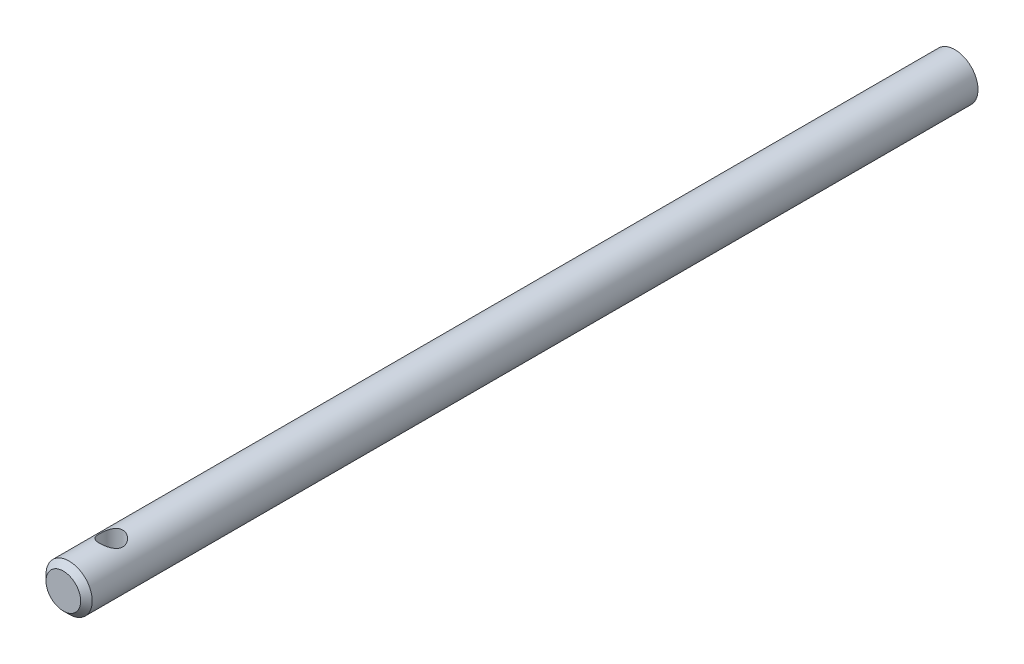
ISO-10303-21;
HEADER;
FILE_DESCRIPTION(('STEP AP214'),'2;1');
FILE_NAME('part.step','',(''),(''),'','','');
FILE_SCHEMA(('AUTOMOTIVE_DESIGN { 1 0 10303 214 1 1 1 1 }'));
ENDSEC;
DATA;
#1=APPLICATION_CONTEXT('core data for automotive mechanical design processes');
#2=APPLICATION_PROTOCOL_DEFINITION('international standard','automotive_design',2000,#1);
#3=PRODUCT_CONTEXT('',#1,'mechanical');
#4=PRODUCT('Part','Part','',(#3));
#5=PRODUCT_RELATED_PRODUCT_CATEGORY('part','',(#4));
#6=PRODUCT_DEFINITION_FORMATION('','',#4);
#7=PRODUCT_DEFINITION_CONTEXT('part definition',#1,'design');
#8=PRODUCT_DEFINITION('design','',#6,#7);
#9=PRODUCT_DEFINITION_SHAPE('','',#8);
#10=(LENGTH_UNIT() NAMED_UNIT(*) SI_UNIT(.MILLI.,.METRE.));
#11=(NAMED_UNIT(*) PLANE_ANGLE_UNIT() SI_UNIT($,.RADIAN.));
#12=(NAMED_UNIT(*) SI_UNIT($,.STERADIAN.) SOLID_ANGLE_UNIT());
#13=UNCERTAINTY_MEASURE_WITH_UNIT(LENGTH_MEASURE(1.E-05),#10,'distance_accuracy_value','');
#14=(GEOMETRIC_REPRESENTATION_CONTEXT(3) GLOBAL_UNCERTAINTY_ASSIGNED_CONTEXT((#13)) GLOBAL_UNIT_ASSIGNED_CONTEXT((#10,
#11,#12)) REPRESENTATION_CONTEXT('',''));
#15=CARTESIAN_POINT('',(0.,0.,0.));
#16=DIRECTION('',(0.,0.,1.));
#17=DIRECTION('',(1.,0.,0.));
#18=AXIS2_PLACEMENT_3D('',#15,#16,#17);
#19=CARTESIAN_POINT('',(0.,0.,78.7));
#20=DIRECTION('',(0.,0.,1.));
#21=DIRECTION('',(1.,0.,0.));
#22=AXIS2_PLACEMENT_3D('',#19,#20,#21);
#23=PLANE('',#22);
#24=CARTESIAN_POINT('',(0.,0.,78.7));
#25=DIRECTION('',(0.,0.,1.));
#26=DIRECTION('',(1.,0.,0.));
#27=AXIS2_PLACEMENT_3D('',#24,#25,#26);
#28=CIRCLE('',#27,5.99999999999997);
#29=CARTESIAN_POINT('',(5.99999999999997,0.,78.7));
#30=VERTEX_POINT('',#29);
#31=EDGE_CURVE('E52',#30,#30,#28,.T.);
#32=ORIENTED_EDGE('',*,*,#31,.T.);
#33=EDGE_LOOP('',(#32));
#34=FACE_BOUND('',#33,.T.);
#35=ADVANCED_FACE('F33',(#34),#23,.T.);
#36=CARTESIAN_POINT('',(0.,0.,-230.));
#37=DIRECTION('',(0.,0.,-1.));
#38=DIRECTION('',(-1.,0.,0.));
#39=AXIS2_PLACEMENT_3D('',#36,#37,#38);
#40=PLANE('',#39);
#41=CARTESIAN_POINT('',(0.,0.,-230.));
#42=DIRECTION('',(0.,0.,1.));
#43=DIRECTION('',(0.,-1.,0.));
#44=AXIS2_PLACEMENT_3D('',#41,#42,#43);
#45=CIRCLE('',#44,8.);
#46=CARTESIAN_POINT('',(0.,-8.,-230.));
#47=VERTEX_POINT('',#46);
#48=EDGE_CURVE('E77',#47,#47,#45,.T.);
#49=ORIENTED_EDGE('',*,*,#48,.F.);
#50=EDGE_LOOP('',(#49));
#51=FACE_BOUND('',#50,.T.);
#52=ADVANCED_FACE('F67',(#51),#40,.T.);
#53=CARTESIAN_POINT('',(0.,0.,50.));
#54=DIRECTION('',(0.,0.,-1.));
#55=DIRECTION('',(0.,-1.,0.));
#56=AXIS2_PLACEMENT_3D('',#53,#54,#55);
#57=CYLINDRICAL_SURFACE('',#56,8.);
#58=CARTESIAN_POINT('',(0.,-8.,66.12));
#59=CARTESIAN_POINT('',(-0.105191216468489,-7.99999964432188,66.1199995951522));
#60=CARTESIAN_POINT('',(-0.210389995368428,-7.99792027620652,66.1158455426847));
#61=CARTESIAN_POINT('',(-0.420011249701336,-7.98965597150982,66.0992779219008));
#62=CARTESIAN_POINT('',(-0.524433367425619,-7.98346924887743,66.0868607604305));
#63=CARTESIAN_POINT('',(-0.731828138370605,-7.96713597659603,66.0538864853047));
#64=CARTESIAN_POINT('',(-0.834798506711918,-7.95698378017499,66.0333177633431));
#65=CARTESIAN_POINT('',(-1.0384152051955,-7.93298382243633,65.9842827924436));
#66=CARTESIAN_POINT('',(-1.1390605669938,-7.91913455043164,65.9558133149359));
#67=CARTESIAN_POINT('',(-1.43561775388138,-7.87265974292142,65.8592517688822));
#68=CARTESIAN_POINT('',(-1.62719620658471,-7.83501976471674,65.7798370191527));
#69=CARTESIAN_POINT('',(-1.99392146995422,-7.74982886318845,65.5937109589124));
#70=CARTESIAN_POINT('',(-2.16906957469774,-7.70227872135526,65.4870018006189));
#71=CARTESIAN_POINT('',(-2.51002321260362,-7.59825056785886,65.2419301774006));
#72=CARTESIAN_POINT('',(-2.67462250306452,-7.54140647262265,65.1020433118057));
#73=CARTESIAN_POINT('',(-2.97911611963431,-7.42640030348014,64.7979248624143));
#74=CARTESIAN_POINT('',(-3.11899161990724,-7.3682372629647,64.6336749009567));
#75=CARTESIAN_POINT('',(-3.38102385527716,-7.25195135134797,64.2700210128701));
#76=CARTESIAN_POINT('',(-3.50096528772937,-7.19418138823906,64.0688786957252));
#77=CARTESIAN_POINT('',(-3.65378721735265,-7.11709930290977,63.7520654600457));
#78=CARTESIAN_POINT('',(-3.70022392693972,-7.09299422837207,63.6439053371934));
#79=CARTESIAN_POINT('',(-3.78359067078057,-7.04887690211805,63.4231990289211));
#80=CARTESIAN_POINT('',(-3.82052633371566,-7.02886222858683,63.3106554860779));
#81=CARTESIAN_POINT('',(-3.88251046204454,-6.9948044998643,63.0888057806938));
#82=CARTESIAN_POINT('',(-3.9081340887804,-6.9804776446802,62.9797035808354));
#83=CARTESIAN_POINT('',(-3.95018060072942,-6.95677065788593,62.7592594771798));
#84=CARTESIAN_POINT('',(-3.96660836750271,-6.9473879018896,62.6479187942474));
#85=CARTESIAN_POINT('',(-3.99001913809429,-6.93396933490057,62.4239939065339));
#86=CARTESIAN_POINT('',(-3.99700782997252,-6.92993030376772,62.3114104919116));
#87=CARTESIAN_POINT('',(-4.00144340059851,-6.92737022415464,62.0859995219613));
#88=CARTESIAN_POINT('',(-3.99889118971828,-6.92884864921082,61.973171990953));
#89=CARTESIAN_POINT('',(-3.98516575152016,-6.93675038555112,61.7618356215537));
#90=CARTESIAN_POINT('',(-3.97506329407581,-6.94255931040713,61.6632325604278));
#91=CARTESIAN_POINT('',(-3.94763759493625,-6.95818925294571,61.4673483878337));
#92=CARTESIAN_POINT('',(-3.9303120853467,-6.96801153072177,61.3700677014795));
#93=CARTESIAN_POINT('',(-3.86777248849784,-7.00304835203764,61.0812208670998));
#94=CARTESIAN_POINT('',(-3.81198555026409,-7.03383903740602,60.8925045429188));
#95=CARTESIAN_POINT('',(-3.67283599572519,-7.10749917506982,60.5230536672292));
#96=CARTESIAN_POINT('',(-3.58886132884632,-7.15063327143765,60.3426074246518));
#97=CARTESIAN_POINT('',(-3.39616568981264,-7.2441365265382,59.9974698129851));
#98=CARTESIAN_POINT('',(-3.28743360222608,-7.29450893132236,59.8327855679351));
#99=CARTESIAN_POINT('',(-3.03227252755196,-7.40452458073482,59.5019171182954));
#100=CARTESIAN_POINT('',(-2.88281182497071,-7.46453347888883,59.3381904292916));
#101=CARTESIAN_POINT('',(-2.55818830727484,-7.58191186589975,59.0370403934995));
#102=CARTESIAN_POINT('',(-2.38301327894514,-7.63928008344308,58.8996296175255));
#103=CARTESIAN_POINT('',(-2.09944472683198,-7.7202760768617,58.7132469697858));
#104=CARTESIAN_POINT('',(-1.9989679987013,-7.74696304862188,58.6533182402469));
#105=CARTESIAN_POINT('',(-1.79256850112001,-7.79730441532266,58.5422335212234));
#106=CARTESIAN_POINT('',(-1.68664805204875,-7.82096008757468,58.4910738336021));
#107=CARTESIAN_POINT('',(-1.47010242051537,-7.86454042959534,58.3980808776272));
#108=CARTESIAN_POINT('',(-1.35947915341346,-7.88446660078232,58.3562438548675));
#109=CARTESIAN_POINT('',(-1.13432950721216,-7.91999221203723,58.2823800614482));
#110=CARTESIAN_POINT('',(-1.01980357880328,-7.9355921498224,58.2503521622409));
#111=CARTESIAN_POINT('',(-0.797438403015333,-7.96087677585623,58.1987731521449));
#112=CARTESIAN_POINT('',(-0.689830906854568,-7.9709443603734,58.178408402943));
#113=CARTESIAN_POINT('',(-0.472998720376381,-7.98674429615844,58.1465535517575));
#114=CARTESIAN_POINT('',(-0.363774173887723,-7.99247703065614,58.135062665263));
#115=CARTESIAN_POINT('',(-0.144648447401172,-7.99944300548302,58.1211095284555));
#116=CARTESIAN_POINT('',(-0.0347475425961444,-8.00067796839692,58.118643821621));
#117=CARTESIAN_POINT('',(0.184837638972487,-7.99861804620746,58.1227642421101));
#118=CARTESIAN_POINT('',(0.294521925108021,-7.99532336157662,58.1293499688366));
#119=CARTESIAN_POINT('',(0.504259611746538,-7.98472734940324,58.1506235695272));
#120=CARTESIAN_POINT('',(0.604398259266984,-7.97775776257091,58.1646410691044));
#121=CARTESIAN_POINT('',(0.803035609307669,-7.96021983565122,58.2001363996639));
#122=CARTESIAN_POINT('',(0.901533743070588,-7.94965027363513,58.2216167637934));
#123=CARTESIAN_POINT('',(1.19351737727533,-7.91289127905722,58.2969351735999));
#124=CARTESIAN_POINT('',(1.38368108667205,-7.88164133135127,58.3616701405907));
#125=CARTESIAN_POINT('',(1.75558493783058,-7.80736894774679,58.5199981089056));
#126=CARTESIAN_POINT('',(1.93692876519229,-7.76403545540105,58.614363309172));
#127=CARTESIAN_POINT('',(2.28183826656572,-7.66975878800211,58.8284310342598));
#128=CARTESIAN_POINT('',(2.44539632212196,-7.61881237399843,58.9481443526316));
#129=CARTESIAN_POINT('',(2.76706877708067,-7.50833088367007,59.2230331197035));
#130=CARTESIAN_POINT('',(2.92307134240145,-7.44844369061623,59.3805365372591));
#131=CARTESIAN_POINT('',(3.20744226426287,-7.33048735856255,59.7197355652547));
#132=CARTESIAN_POINT('',(3.33579150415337,-7.27241950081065,59.9014477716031));
#133=CARTESIAN_POINT('',(3.50772930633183,-7.19028164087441,60.1939940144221));
#134=CARTESIAN_POINT('',(3.5626157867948,-7.16316684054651,60.2974837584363));
#135=CARTESIAN_POINT('',(3.66334616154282,-7.11217812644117,60.5095184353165));
#136=CARTESIAN_POINT('',(3.70919441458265,-7.08830265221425,60.6180609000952));
#137=CARTESIAN_POINT('',(3.79131200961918,-7.04472262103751,60.8394216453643));
#138=CARTESIAN_POINT('',(3.82758904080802,-7.02501471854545,60.9522364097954));
#139=CARTESIAN_POINT('',(3.89012004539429,-6.9905825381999,61.1813527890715));
#140=CARTESIAN_POINT('',(3.91637557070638,-6.97585748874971,61.2976538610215));
#141=CARTESIAN_POINT('',(3.95643062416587,-6.95321025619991,61.5214121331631));
#142=CARTESIAN_POINT('',(3.97118378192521,-6.94477079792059,61.6286468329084));
#143=CARTESIAN_POINT('',(3.99195118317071,-6.93285441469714,61.8442276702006));
#144=CARTESIAN_POINT('',(3.99796634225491,-6.92937696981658,61.9525736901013));
#145=CARTESIAN_POINT('',(4.00116308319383,-6.92753208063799,62.1694074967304));
#146=CARTESIAN_POINT('',(3.99834777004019,-6.9291628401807,62.2778952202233));
#147=CARTESIAN_POINT('',(3.98394653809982,-6.9374509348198,62.4940611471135));
#148=CARTESIAN_POINT('',(3.97236097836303,-6.94410806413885,62.6017393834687));
#149=CARTESIAN_POINT('',(3.92770249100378,-6.9695287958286,62.9018001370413));
#150=CARTESIAN_POINT('',(3.88483285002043,-6.99372760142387,63.0923658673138));
#151=CARTESIAN_POINT('',(3.77270184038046,-7.05483682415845,63.4632685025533));
#152=CARTESIAN_POINT('',(3.70343198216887,-7.09175132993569,63.6436020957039));
#153=CARTESIAN_POINT('',(3.53526338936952,-7.17714225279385,64.002488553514));
#154=CARTESIAN_POINT('',(3.43468670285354,-7.22622883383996,64.1801077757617));
#155=CARTESIAN_POINT('',(3.20860173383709,-7.32941332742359,64.517101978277));
#156=CARTESIAN_POINT('',(3.08308048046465,-7.38351383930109,64.6764673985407));
#157=CARTESIAN_POINT('',(2.7928225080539,-7.49849148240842,64.9925629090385));
#158=CARTESIAN_POINT('',(2.62517402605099,-7.55939328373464,65.1466199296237));
#159=CARTESIAN_POINT('',(2.26458287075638,-7.67511613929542,65.4250684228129));
#160=CARTESIAN_POINT('',(2.07162664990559,-7.72993390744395,65.5494439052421));
#161=CARTESIAN_POINT('',(1.76603106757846,-7.80335210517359,65.7109042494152));
#162=CARTESIAN_POINT('',(1.66100410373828,-7.82643367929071,65.7606936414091));
#163=CARTESIAN_POINT('',(1.44639623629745,-7.8689179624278,65.8511489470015));
#164=CARTESIAN_POINT('',(1.33681760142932,-7.88832247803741,65.8918193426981));
#165=CARTESIAN_POINT('',(1.11415600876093,-7.92283587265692,65.963476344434));
#166=CARTESIAN_POINT('',(1.00108129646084,-7.93795411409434,65.9944840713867));
#167=CARTESIAN_POINT('',(0.772189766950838,-7.96347694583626,66.0465100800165));
#168=CARTESIAN_POINT('',(0.65637467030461,-7.97388441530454,66.0675344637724));
#169=CARTESIAN_POINT('',(0.450433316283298,-7.98781110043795,66.0955796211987));
#170=CARTESIAN_POINT('',(0.360660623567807,-7.99237392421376,66.1047293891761));
#171=CARTESIAN_POINT('',(0.180593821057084,-7.99846856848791,66.1169398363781));
#172=CARTESIAN_POINT('',(0.0902996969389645,-8.00000030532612,66.120000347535));
#173=CARTESIAN_POINT('',(0.,-8.,66.12));
#174=B_SPLINE_CURVE_WITH_KNOTS('',3,(#58,#59,#60,#61,#62,#63,#64,#65,#66,#67,#68,#69,#70,#71,
#72,#73,#74,#75,#76,#77,#78,#79,#80,#81,#82,#83,#84,#85,#86,#87,#88,#89,#90,#91,#92,#93,#94,#95,
#96,#97,#98,#99,#100,#101,#102,#103,#104,#105,#106,#107,#108,#109,#110,#111,#112,#113,#114,#115,
#116,#117,#118,#119,#120,#121,#122,#123,#124,#125,#126,#127,#128,#129,#130,#131,#132,#133,#134,
#135,#136,#137,#138,#139,#140,#141,#142,#143,#144,#145,#146,#147,#148,#149,#150,#151,#152,#153,
#154,#155,#156,#157,#158,#159,#160,#161,#162,#163,#164,#165,#166,#167,#168,#169,#170,#171,#172,
#173),.UNSPECIFIED.,.T.,.F.,(4,2,2,2,2,2,2,2,2,2,2,2,2,2,2,2,2,2,2,2,2,2,2,2,2,2,2,2,2,2,2,2,2,
2,2,2,2,2,2,2,2,2,2,2,2,2,2,2,2,2,2,2,2,2,2,2,2,4),(0.,0.315484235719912,0.631105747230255,
0.947178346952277,1.26338029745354,1.89263632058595,2.52184274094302,3.1891147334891,
3.8568926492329,4.57645675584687,4.93648208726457,5.29629363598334,5.63476191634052,
5.97305035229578,6.31113484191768,6.64918707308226,6.94669148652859,7.24428938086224,
7.83905304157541,8.44767049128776,9.05656173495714,9.74265853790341,10.4290822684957,
10.7886699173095,11.1481055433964,11.5073961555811,11.8666454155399,12.1961419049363,
12.5256092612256,12.8549504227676,13.184277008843,13.4879760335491,13.791778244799,
14.3988188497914,15.0232162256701,15.6478800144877,16.33388641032,17.0203655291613,
17.380682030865,17.7408243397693,18.1006764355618,18.4604727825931,18.7857371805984,
19.1109674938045,19.4360834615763,19.7611861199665,20.3488209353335,20.9366448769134,
21.5639619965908,22.1916061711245,22.8955134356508,23.5997990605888,23.9548906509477,
24.3098073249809,24.6639426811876,25.0178613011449,25.2886761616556,25.5594984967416),.UNSPECIFIED.);
#175=CARTESIAN_POINT('',(0.,-8.,66.12));
#176=VERTEX_POINT('',#175);
#177=EDGE_CURVE('E10',#176,#176,#174,.T.);
#178=ORIENTED_EDGE('',*,*,#177,.F.);
#179=EDGE_LOOP('',(#178));
#180=FACE_BOUND('',#179,.T.);
#181=CARTESIAN_POINT('',(0.,8.,66.12));
#182=CARTESIAN_POINT('',(0.105191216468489,7.99999964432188,66.1199995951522));
#183=CARTESIAN_POINT('',(0.210389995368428,7.99792027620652,66.1158455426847));
#184=CARTESIAN_POINT('',(0.420011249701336,7.98965597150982,66.0992779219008));
#185=CARTESIAN_POINT('',(0.524433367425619,7.98346924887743,66.0868607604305));
#186=CARTESIAN_POINT('',(0.731828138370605,7.96713597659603,66.0538864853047));
#187=CARTESIAN_POINT('',(0.834798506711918,7.95698378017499,66.0333177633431));
#188=CARTESIAN_POINT('',(1.0384152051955,7.93298382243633,65.9842827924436));
#189=CARTESIAN_POINT('',(1.1390605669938,7.91913455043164,65.9558133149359));
#190=CARTESIAN_POINT('',(1.43561775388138,7.87265974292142,65.8592517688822));
#191=CARTESIAN_POINT('',(1.62719620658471,7.83501976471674,65.7798370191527));
#192=CARTESIAN_POINT('',(1.99392146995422,7.74982886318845,65.5937109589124));
#193=CARTESIAN_POINT('',(2.16906957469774,7.70227872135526,65.4870018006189));
#194=CARTESIAN_POINT('',(2.51002321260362,7.59825056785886,65.2419301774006));
#195=CARTESIAN_POINT('',(2.67462250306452,7.54140647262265,65.1020433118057));
#196=CARTESIAN_POINT('',(2.97911611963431,7.42640030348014,64.7979248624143));
#197=CARTESIAN_POINT('',(3.11899161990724,7.3682372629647,64.6336749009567));
#198=CARTESIAN_POINT('',(3.38102385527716,7.25195135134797,64.2700210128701));
#199=CARTESIAN_POINT('',(3.50096528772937,7.19418138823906,64.0688786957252));
#200=CARTESIAN_POINT('',(3.65378721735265,7.11709930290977,63.7520654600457));
#201=CARTESIAN_POINT('',(3.70022392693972,7.09299422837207,63.6439053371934));
#202=CARTESIAN_POINT('',(3.78359067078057,7.04887690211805,63.4231990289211));
#203=CARTESIAN_POINT('',(3.82052633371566,7.02886222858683,63.3106554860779));
#204=CARTESIAN_POINT('',(3.88251046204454,6.9948044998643,63.0888057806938));
#205=CARTESIAN_POINT('',(3.9081340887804,6.9804776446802,62.9797035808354));
#206=CARTESIAN_POINT('',(3.95018060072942,6.95677065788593,62.7592594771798));
#207=CARTESIAN_POINT('',(3.96660836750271,6.9473879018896,62.6479187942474));
#208=CARTESIAN_POINT('',(3.99001913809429,6.93396933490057,62.4239939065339));
#209=CARTESIAN_POINT('',(3.99700782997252,6.92993030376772,62.3114104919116));
#210=CARTESIAN_POINT('',(4.00144340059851,6.92737022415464,62.0859995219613));
#211=CARTESIAN_POINT('',(3.99889118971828,6.92884864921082,61.973171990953));
#212=CARTESIAN_POINT('',(3.98516575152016,6.93675038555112,61.7618356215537));
#213=CARTESIAN_POINT('',(3.97506329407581,6.94255931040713,61.6632325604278));
#214=CARTESIAN_POINT('',(3.94763759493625,6.95818925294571,61.4673483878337));
#215=CARTESIAN_POINT('',(3.9303120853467,6.96801153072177,61.3700677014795));
#216=CARTESIAN_POINT('',(3.86777248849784,7.00304835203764,61.0812208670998));
#217=CARTESIAN_POINT('',(3.81198555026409,7.03383903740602,60.8925045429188));
#218=CARTESIAN_POINT('',(3.67283599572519,7.10749917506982,60.5230536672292));
#219=CARTESIAN_POINT('',(3.58886132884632,7.15063327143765,60.3426074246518));
#220=CARTESIAN_POINT('',(3.39616568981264,7.2441365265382,59.9974698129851));
#221=CARTESIAN_POINT('',(3.28743360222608,7.29450893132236,59.8327855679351));
#222=CARTESIAN_POINT('',(3.03227252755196,7.40452458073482,59.5019171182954));
#223=CARTESIAN_POINT('',(2.88281182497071,7.46453347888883,59.3381904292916));
#224=CARTESIAN_POINT('',(2.55818830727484,7.58191186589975,59.0370403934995));
#225=CARTESIAN_POINT('',(2.38301327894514,7.63928008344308,58.8996296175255));
#226=CARTESIAN_POINT('',(2.09944472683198,7.7202760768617,58.7132469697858));
#227=CARTESIAN_POINT('',(1.9989679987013,7.74696304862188,58.6533182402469));
#228=CARTESIAN_POINT('',(1.79256850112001,7.79730441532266,58.5422335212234));
#229=CARTESIAN_POINT('',(1.68664805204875,7.82096008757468,58.4910738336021));
#230=CARTESIAN_POINT('',(1.47010242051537,7.86454042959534,58.3980808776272));
#231=CARTESIAN_POINT('',(1.35947915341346,7.88446660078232,58.3562438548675));
#232=CARTESIAN_POINT('',(1.13432950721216,7.91999221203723,58.2823800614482));
#233=CARTESIAN_POINT('',(1.01980357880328,7.9355921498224,58.2503521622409));
#234=CARTESIAN_POINT('',(0.797438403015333,7.96087677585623,58.1987731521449));
#235=CARTESIAN_POINT('',(0.689830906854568,7.9709443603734,58.178408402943));
#236=CARTESIAN_POINT('',(0.472998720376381,7.98674429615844,58.1465535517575));
#237=CARTESIAN_POINT('',(0.363774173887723,7.99247703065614,58.135062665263));
#238=CARTESIAN_POINT('',(0.144648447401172,7.99944300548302,58.1211095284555));
#239=CARTESIAN_POINT('',(0.0347475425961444,8.00067796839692,58.118643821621));
#240=CARTESIAN_POINT('',(-0.184837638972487,7.99861804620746,58.1227642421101));
#241=CARTESIAN_POINT('',(-0.294521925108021,7.99532336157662,58.1293499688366));
#242=CARTESIAN_POINT('',(-0.504259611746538,7.98472734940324,58.1506235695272));
#243=CARTESIAN_POINT('',(-0.604398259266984,7.97775776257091,58.1646410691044));
#244=CARTESIAN_POINT('',(-0.803035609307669,7.96021983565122,58.2001363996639));
#245=CARTESIAN_POINT('',(-0.901533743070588,7.94965027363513,58.2216167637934));
#246=CARTESIAN_POINT('',(-1.19351737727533,7.91289127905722,58.2969351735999));
#247=CARTESIAN_POINT('',(-1.38368108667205,7.88164133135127,58.3616701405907));
#248=CARTESIAN_POINT('',(-1.75558493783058,7.80736894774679,58.5199981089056));
#249=CARTESIAN_POINT('',(-1.93692876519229,7.76403545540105,58.614363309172));
#250=CARTESIAN_POINT('',(-2.28183826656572,7.66975878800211,58.8284310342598));
#251=CARTESIAN_POINT('',(-2.44539632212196,7.61881237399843,58.9481443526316));
#252=CARTESIAN_POINT('',(-2.76706877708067,7.50833088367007,59.2230331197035));
#253=CARTESIAN_POINT('',(-2.92307134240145,7.44844369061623,59.3805365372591));
#254=CARTESIAN_POINT('',(-3.20744226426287,7.33048735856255,59.7197355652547));
#255=CARTESIAN_POINT('',(-3.33579150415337,7.27241950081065,59.9014477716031));
#256=CARTESIAN_POINT('',(-3.50772930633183,7.19028164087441,60.1939940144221));
#257=CARTESIAN_POINT('',(-3.5626157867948,7.16316684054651,60.2974837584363));
#258=CARTESIAN_POINT('',(-3.66334616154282,7.11217812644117,60.5095184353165));
#259=CARTESIAN_POINT('',(-3.70919441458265,7.08830265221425,60.6180609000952));
#260=CARTESIAN_POINT('',(-3.79131200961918,7.04472262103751,60.8394216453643));
#261=CARTESIAN_POINT('',(-3.82758904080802,7.02501471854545,60.9522364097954));
#262=CARTESIAN_POINT('',(-3.89012004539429,6.9905825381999,61.1813527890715));
#263=CARTESIAN_POINT('',(-3.91637557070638,6.97585748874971,61.2976538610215));
#264=CARTESIAN_POINT('',(-3.95643062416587,6.95321025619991,61.5214121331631));
#265=CARTESIAN_POINT('',(-3.97118378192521,6.94477079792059,61.6286468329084));
#266=CARTESIAN_POINT('',(-3.99195118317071,6.93285441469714,61.8442276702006));
#267=CARTESIAN_POINT('',(-3.99796634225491,6.92937696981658,61.9525736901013));
#268=CARTESIAN_POINT('',(-4.00116308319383,6.92753208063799,62.1694074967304));
#269=CARTESIAN_POINT('',(-3.99834777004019,6.9291628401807,62.2778952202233));
#270=CARTESIAN_POINT('',(-3.98394653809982,6.9374509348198,62.4940611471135));
#271=CARTESIAN_POINT('',(-3.97236097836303,6.94410806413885,62.6017393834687));
#272=CARTESIAN_POINT('',(-3.92770249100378,6.9695287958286,62.9018001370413));
#273=CARTESIAN_POINT('',(-3.88483285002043,6.99372760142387,63.0923658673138));
#274=CARTESIAN_POINT('',(-3.77270184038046,7.05483682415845,63.4632685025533));
#275=CARTESIAN_POINT('',(-3.70343198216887,7.09175132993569,63.6436020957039));
#276=CARTESIAN_POINT('',(-3.53526338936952,7.17714225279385,64.002488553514));
#277=CARTESIAN_POINT('',(-3.43468670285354,7.22622883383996,64.1801077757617));
#278=CARTESIAN_POINT('',(-3.20860173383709,7.32941332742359,64.517101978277));
#279=CARTESIAN_POINT('',(-3.08308048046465,7.38351383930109,64.6764673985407));
#280=CARTESIAN_POINT('',(-2.7928225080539,7.49849148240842,64.9925629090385));
#281=CARTESIAN_POINT('',(-2.62517402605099,7.55939328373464,65.1466199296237));
#282=CARTESIAN_POINT('',(-2.26458287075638,7.67511613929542,65.4250684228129));
#283=CARTESIAN_POINT('',(-2.07162664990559,7.72993390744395,65.5494439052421));
#284=CARTESIAN_POINT('',(-1.76603106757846,7.80335210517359,65.7109042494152));
#285=CARTESIAN_POINT('',(-1.66100410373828,7.82643367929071,65.7606936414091));
#286=CARTESIAN_POINT('',(-1.44639623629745,7.8689179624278,65.8511489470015));
#287=CARTESIAN_POINT('',(-1.33681760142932,7.88832247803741,65.8918193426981));
#288=CARTESIAN_POINT('',(-1.11415600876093,7.92283587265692,65.963476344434));
#289=CARTESIAN_POINT('',(-1.00108129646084,7.93795411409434,65.9944840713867));
#290=CARTESIAN_POINT('',(-0.772189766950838,7.96347694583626,66.0465100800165));
#291=CARTESIAN_POINT('',(-0.65637467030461,7.97388441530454,66.0675344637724));
#292=CARTESIAN_POINT('',(-0.450433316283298,7.98781110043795,66.0955796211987));
#293=CARTESIAN_POINT('',(-0.360660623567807,7.99237392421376,66.1047293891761));
#294=CARTESIAN_POINT('',(-0.180593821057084,7.99846856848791,66.1169398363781));
#295=CARTESIAN_POINT('',(-0.0902996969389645,8.00000030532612,66.120000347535));
#296=CARTESIAN_POINT('',(0.,8.,66.12));
#297=B_SPLINE_CURVE_WITH_KNOTS('',3,(#181,#182,#183,#184,#185,#186,#187,#188,#189,#190,#191,
#192,#193,#194,#195,#196,#197,#198,#199,#200,#201,#202,#203,#204,#205,#206,#207,#208,#209,#210,
#211,#212,#213,#214,#215,#216,#217,#218,#219,#220,#221,#222,#223,#224,#225,#226,#227,#228,#229,
#230,#231,#232,#233,#234,#235,#236,#237,#238,#239,#240,#241,#242,#243,#244,#245,#246,#247,#248,
#249,#250,#251,#252,#253,#254,#255,#256,#257,#258,#259,#260,#261,#262,#263,#264,#265,#266,#267,
#268,#269,#270,#271,#272,#273,#274,#275,#276,#277,#278,#279,#280,#281,#282,#283,#284,#285,#286,
#287,#288,#289,#290,#291,#292,#293,#294,#295,#296),.UNSPECIFIED.,.T.,.F.,(4,2,2,2,2,2,2,2,2,2,2,
2,2,2,2,2,2,2,2,2,2,2,2,2,2,2,2,2,2,2,2,2,2,2,2,2,2,2,2,2,2,2,2,2,2,2,2,2,2,2,2,2,2,2,2,2,2,4),
(0.,0.315484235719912,0.631105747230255,0.947178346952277,1.26338029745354,1.89263632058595,
2.52184274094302,3.1891147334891,3.8568926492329,4.57645675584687,4.93648208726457,
5.29629363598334,5.63476191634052,5.97305035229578,6.31113484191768,6.64918707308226,
6.94669148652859,7.24428938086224,7.83905304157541,8.44767049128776,9.05656173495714,
9.74265853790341,10.4290822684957,10.7886699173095,11.1481055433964,11.5073961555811,
11.8666454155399,12.1961419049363,12.5256092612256,12.8549504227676,13.184277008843,
13.4879760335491,13.791778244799,14.3988188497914,15.0232162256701,15.6478800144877,
16.33388641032,17.0203655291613,17.380682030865,17.7408243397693,18.1006764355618,
18.4604727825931,18.7857371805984,19.1109674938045,19.4360834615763,19.7611861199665,
20.3488209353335,20.9366448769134,21.5639619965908,22.1916061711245,22.8955134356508,
23.5997990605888,23.9548906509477,24.3098073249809,24.6639426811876,25.0178613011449,
25.2886761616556,25.5594984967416),.UNSPECIFIED.);
#298=CARTESIAN_POINT('',(0.,8.,66.12));
#299=VERTEX_POINT('',#298);
#300=EDGE_CURVE('E44',#299,#299,#297,.T.);
#301=ORIENTED_EDGE('',*,*,#300,.F.);
#302=EDGE_LOOP('',(#301));
#303=FACE_BOUND('',#302,.T.);
#304=CARTESIAN_POINT('',(0.,0.,76.7));
#305=DIRECTION('',(0.,0.,1.));
#306=DIRECTION('',(1.,0.,0.));
#307=AXIS2_PLACEMENT_3D('',#304,#305,#306);
#308=CIRCLE('',#307,8.);
#309=CARTESIAN_POINT('',(8.,0.,76.7));
#310=VERTEX_POINT('',#309);
#311=EDGE_CURVE('E48',#310,#310,#308,.F.);
#312=ORIENTED_EDGE('',*,*,#311,.T.);
#313=EDGE_LOOP('',(#312));
#314=FACE_BOUND('',#313,.T.);
#315=ORIENTED_EDGE('',*,*,#48,.T.);
#316=EDGE_LOOP('',(#315));
#317=FACE_BOUND('',#316,.T.);
#318=ADVANCED_FACE('F35',(#180,#303,#314,#317),#57,.T.);
#319=CARTESIAN_POINT('',(0.,0.,78.7));
#320=DIRECTION('',(0.,0.,-1.));
#321=DIRECTION('',(-1.,0.,0.));
#322=AXIS2_PLACEMENT_3D('',#319,#320,#321);
#323=CONICAL_SURFACE('',#322,5.99999999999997,0.785398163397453);
#324=ORIENTED_EDGE('',*,*,#311,.F.);
#325=EDGE_LOOP('',(#324));
#326=FACE_BOUND('',#325,.T.);
#327=ORIENTED_EDGE('',*,*,#31,.F.);
#328=EDGE_LOOP('',(#327));
#329=FACE_BOUND('',#328,.T.);
#330=ADVANCED_FACE('F61',(#326,#329),#323,.T.);
#331=CARTESIAN_POINT('',(0.,-8.,62.12));
#332=DIRECTION('',(0.,1.,0.));
#333=DIRECTION('',(0.,0.,1.));
#334=AXIS2_PLACEMENT_3D('',#331,#332,#333);
#335=CYLINDRICAL_SURFACE('',#334,4.);
#336=ORIENTED_EDGE('',*,*,#177,.T.);
#337=EDGE_LOOP('',(#336));
#338=FACE_BOUND('',#337,.T.);
#339=ORIENTED_EDGE('',*,*,#300,.T.);
#340=EDGE_LOOP('',(#339));
#341=FACE_BOUND('',#340,.T.);
#342=ADVANCED_FACE('F57',(#338,#341),#335,.F.);
#343=CLOSED_SHELL('',(#35,#52,#318,#330,#342));
#344=MANIFOLD_SOLID_BREP('B2',#343);
#345=ADVANCED_BREP_SHAPE_REPRESENTATION('',(#18,#344),#14);
#346=SHAPE_DEFINITION_REPRESENTATION(#9,#345);
ENDSEC;
END-ISO-10303-21;
